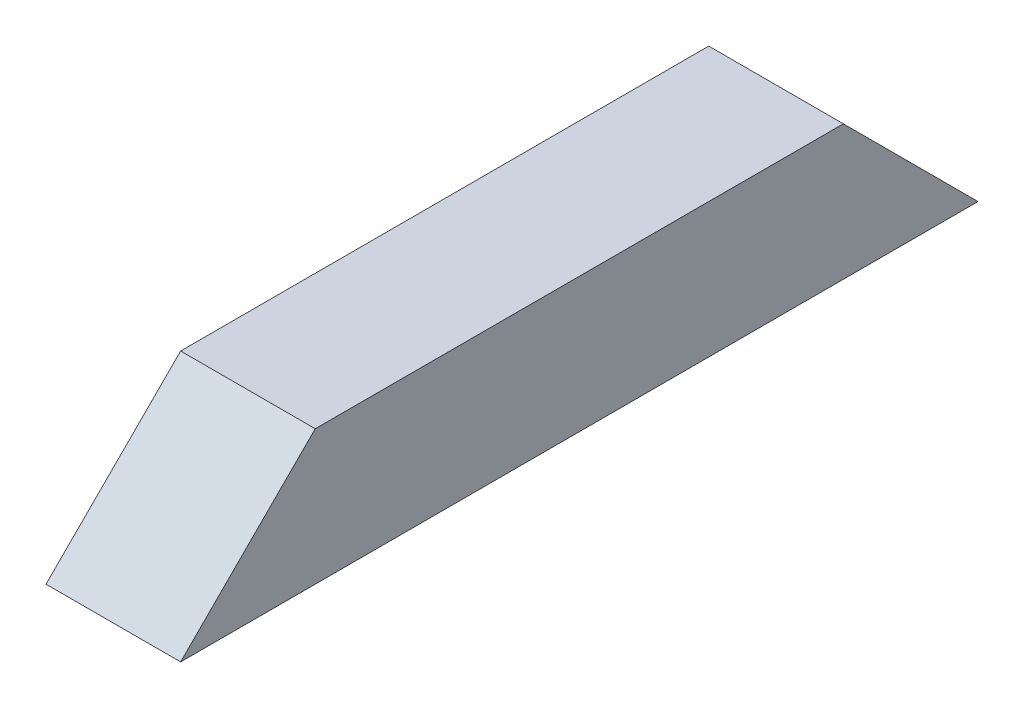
ISO-10303-21;
HEADER;
FILE_DESCRIPTION(('STEP AP214'),'2;1');
FILE_NAME('part.step','',(''),(''),'','','');
FILE_SCHEMA(('AUTOMOTIVE_DESIGN { 1 0 10303 214 1 1 1 1 }'));
ENDSEC;
DATA;
#1=APPLICATION_CONTEXT('core data for automotive mechanical design processes');
#2=APPLICATION_PROTOCOL_DEFINITION('international standard','automotive_design',2000,#1);
#3=PRODUCT_CONTEXT('',#1,'mechanical');
#4=PRODUCT('Part','Part','',(#3));
#5=PRODUCT_RELATED_PRODUCT_CATEGORY('part','',(#4));
#6=PRODUCT_DEFINITION_FORMATION('','',#4);
#7=PRODUCT_DEFINITION_CONTEXT('part definition',#1,'design');
#8=PRODUCT_DEFINITION('design','',#6,#7);
#9=PRODUCT_DEFINITION_SHAPE('','',#8);
#10=(LENGTH_UNIT() NAMED_UNIT(*) SI_UNIT(.MILLI.,.METRE.));
#11=(NAMED_UNIT(*) PLANE_ANGLE_UNIT() SI_UNIT($,.RADIAN.));
#12=(NAMED_UNIT(*) SI_UNIT($,.STERADIAN.) SOLID_ANGLE_UNIT());
#13=UNCERTAINTY_MEASURE_WITH_UNIT(LENGTH_MEASURE(1.E-05),#10,'distance_accuracy_value','');
#14=(GEOMETRIC_REPRESENTATION_CONTEXT(3) GLOBAL_UNCERTAINTY_ASSIGNED_CONTEXT((#13)) GLOBAL_UNIT_ASSIGNED_CONTEXT((#10,
#11,#12)) REPRESENTATION_CONTEXT('',''));
#15=CARTESIAN_POINT('',(0.,0.,0.));
#16=DIRECTION('',(0.,0.,1.));
#17=DIRECTION('',(1.,0.,0.));
#18=AXIS2_PLACEMENT_3D('',#15,#16,#17);
#19=CARTESIAN_POINT('',(-6.5,6.5,38.5));
#20=DIRECTION('',(1.,0.,0.));
#21=DIRECTION('',(0.,0.,-1.));
#22=AXIS2_PLACEMENT_3D('',#19,#20,#21);
#23=PLANE('',#22);
#24=DIRECTION('',(0.,0.,-1.));
#25=VECTOR('',#24,1.);
#26=CARTESIAN_POINT('',(-6.5,6.5,38.5));
#27=LINE('',#26,#25);
#28=CARTESIAN_POINT('',(-6.50000000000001,6.5,25.5));
#29=VERTEX_POINT('',#28);
#30=CARTESIAN_POINT('',(-6.50000000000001,6.5,-25.5));
#31=VERTEX_POINT('',#30);
#32=EDGE_CURVE('E88',#29,#31,#27,.T.);
#33=ORIENTED_EDGE('',*,*,#32,.T.);
#34=DIRECTION('',(0.,-0.707106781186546,-0.707106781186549));
#35=VECTOR('',#34,1.);
#36=CARTESIAN_POINT('',(-6.5,38.5,6.50000000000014));
#37=LINE('',#36,#35);
#38=CARTESIAN_POINT('',(-6.50000000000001,-6.5,-38.5));
#39=VERTEX_POINT('',#38);
#40=EDGE_CURVE('E71',#31,#39,#37,.T.);
#41=ORIENTED_EDGE('',*,*,#40,.T.);
#42=DIRECTION('',(0.,0.,-1.));
#43=VECTOR('',#42,1.);
#44=CARTESIAN_POINT('',(-6.5,-6.5,38.5));
#45=LINE('',#44,#43);
#46=CARTESIAN_POINT('',(-6.5,-6.5,38.5));
#47=VERTEX_POINT('',#46);
#48=EDGE_CURVE('E11',#47,#39,#45,.T.);
#49=ORIENTED_EDGE('',*,*,#48,.F.);
#50=DIRECTION('',(0.,0.707106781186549,-0.707106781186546));
#51=VECTOR('',#50,1.);
#52=CARTESIAN_POINT('',(-6.5,0.,32.));
#53=LINE('',#52,#51);
#54=EDGE_CURVE('E44',#47,#29,#53,.T.);
#55=ORIENTED_EDGE('',*,*,#54,.T.);
#56=EDGE_LOOP('',(#33,#41,#49,#55));
#57=FACE_BOUND('',#56,.T.);
#58=ADVANCED_FACE('F30',(#57),#23,.F.);
#59=CARTESIAN_POINT('',(-6.5,-6.5,38.5));
#60=DIRECTION('',(0.,1.,0.));
#61=DIRECTION('',(0.,0.,1.));
#62=AXIS2_PLACEMENT_3D('',#59,#60,#61);
#63=PLANE('',#62);
#64=DIRECTION('',(1.,0.,0.));
#65=VECTOR('',#64,1.);
#66=CARTESIAN_POINT('',(-6.5,-6.5,-38.5));
#67=LINE('',#66,#65);
#68=CARTESIAN_POINT('',(6.5,-6.5,-38.5));
#69=VERTEX_POINT('',#68);
#70=EDGE_CURVE('E94',#39,#69,#67,.T.);
#71=ORIENTED_EDGE('',*,*,#70,.T.);
#72=DIRECTION('',(0.,0.,-1.));
#73=VECTOR('',#72,1.);
#74=CARTESIAN_POINT('',(6.5,-6.5,38.5));
#75=LINE('',#74,#73);
#76=CARTESIAN_POINT('',(6.5,-6.5,38.5));
#77=VERTEX_POINT('',#76);
#78=EDGE_CURVE('E37',#77,#69,#75,.T.);
#79=ORIENTED_EDGE('',*,*,#78,.F.);
#80=DIRECTION('',(1.,0.,0.));
#81=VECTOR('',#80,1.);
#82=CARTESIAN_POINT('',(-6.5,-6.5,38.5));
#83=LINE('',#82,#81);
#84=EDGE_CURVE('E90',#47,#77,#83,.T.);
#85=ORIENTED_EDGE('',*,*,#84,.F.);
#86=ORIENTED_EDGE('',*,*,#48,.T.);
#87=EDGE_LOOP('',(#71,#79,#85,#86));
#88=FACE_BOUND('',#87,.T.);
#89=ADVANCED_FACE('F103',(#88),#63,.F.);
#90=CARTESIAN_POINT('',(6.5,6.5,38.5));
#91=DIRECTION('',(-1.,0.,0.));
#92=DIRECTION('',(0.,0.,1.));
#93=AXIS2_PLACEMENT_3D('',#90,#91,#92);
#94=PLANE('',#93);
#95=ORIENTED_EDGE('',*,*,#78,.T.);
#96=DIRECTION('',(0.,-0.707106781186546,-0.707106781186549));
#97=VECTOR('',#96,1.);
#98=CARTESIAN_POINT('',(6.5,-6.5,-38.5));
#99=LINE('',#98,#97);
#100=CARTESIAN_POINT('',(6.5,6.5,-25.5));
#101=VERTEX_POINT('',#100);
#102=EDGE_CURVE('E52',#101,#69,#99,.T.);
#103=ORIENTED_EDGE('',*,*,#102,.F.);
#104=DIRECTION('',(0.,0.,-1.));
#105=VECTOR('',#104,1.);
#106=CARTESIAN_POINT('',(6.5,6.5,38.5));
#107=LINE('',#106,#105);
#108=CARTESIAN_POINT('',(6.5,6.5,25.5));
#109=VERTEX_POINT('',#108);
#110=EDGE_CURVE('E82',#109,#101,#107,.T.);
#111=ORIENTED_EDGE('',*,*,#110,.F.);
#112=DIRECTION('',(0.,0.707106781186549,-0.707106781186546));
#113=VECTOR('',#112,1.);
#114=CARTESIAN_POINT('',(6.5,-6.5,38.5));
#115=LINE('',#114,#113);
#116=EDGE_CURVE('E98',#77,#109,#115,.T.);
#117=ORIENTED_EDGE('',*,*,#116,.F.);
#118=EDGE_LOOP('',(#95,#103,#111,#117));
#119=FACE_BOUND('',#118,.T.);
#120=ADVANCED_FACE('F80',(#119),#94,.F.);
#121=CARTESIAN_POINT('',(-6.5,6.5,38.5));
#122=DIRECTION('',(0.,-1.,0.));
#123=DIRECTION('',(0.,0.,-1.));
#124=AXIS2_PLACEMENT_3D('',#121,#122,#123);
#125=PLANE('',#124);
#126=ORIENTED_EDGE('',*,*,#110,.T.);
#127=DIRECTION('',(1.,0.,0.));
#128=VECTOR('',#127,1.);
#129=CARTESIAN_POINT('',(-293.5,6.5,-25.5));
#130=LINE('',#129,#128);
#131=EDGE_CURVE('E68',#31,#101,#130,.T.);
#132=ORIENTED_EDGE('',*,*,#131,.F.);
#133=ORIENTED_EDGE('',*,*,#32,.F.);
#134=DIRECTION('',(1.,0.,0.));
#135=VECTOR('',#134,1.);
#136=CARTESIAN_POINT('',(-293.5,6.5,25.5));
#137=LINE('',#136,#135);
#138=EDGE_CURVE('E87',#29,#109,#137,.T.);
#139=ORIENTED_EDGE('',*,*,#138,.T.);
#140=EDGE_LOOP('',(#126,#132,#133,#139));
#141=FACE_BOUND('',#140,.T.);
#142=ADVANCED_FACE('F86',(#141),#125,.F.);
#143=CARTESIAN_POINT('',(-293.5,-6.5,38.5));
#144=DIRECTION('',(0.,-0.707106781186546,-0.707106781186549));
#145=DIRECTION('',(0.,0.707106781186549,-0.707106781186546));
#146=AXIS2_PLACEMENT_3D('',#143,#144,#145);
#147=PLANE('',#146);
#148=ORIENTED_EDGE('',*,*,#84,.T.);
#149=ORIENTED_EDGE('',*,*,#116,.T.);
#150=ORIENTED_EDGE('',*,*,#138,.F.);
#151=ORIENTED_EDGE('',*,*,#54,.F.);
#152=EDGE_LOOP('',(#148,#149,#150,#151));
#153=FACE_BOUND('',#152,.T.);
#154=ADVANCED_FACE('F104',(#153),#147,.F.);
#155=CARTESIAN_POINT('',(-293.5,-6.5,-38.5));
#156=DIRECTION('',(0.,-0.707106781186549,0.707106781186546));
#157=DIRECTION('',(0.,-0.707106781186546,-0.707106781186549));
#158=AXIS2_PLACEMENT_3D('',#155,#156,#157);
#159=PLANE('',#158);
#160=ORIENTED_EDGE('',*,*,#131,.T.);
#161=ORIENTED_EDGE('',*,*,#102,.T.);
#162=ORIENTED_EDGE('',*,*,#70,.F.);
#163=ORIENTED_EDGE('',*,*,#40,.F.);
#164=EDGE_LOOP('',(#160,#161,#162,#163));
#165=FACE_BOUND('',#164,.T.);
#166=ADVANCED_FACE('F69',(#165),#159,.F.);
#167=CLOSED_SHELL('',(#58,#89,#120,#142,#154,#166));
#168=MANIFOLD_SOLID_BREP('B2',#167);
#169=ADVANCED_BREP_SHAPE_REPRESENTATION('',(#18,#168),#14);
#170=SHAPE_DEFINITION_REPRESENTATION(#9,#169);
ENDSEC;
END-ISO-10303-21;
